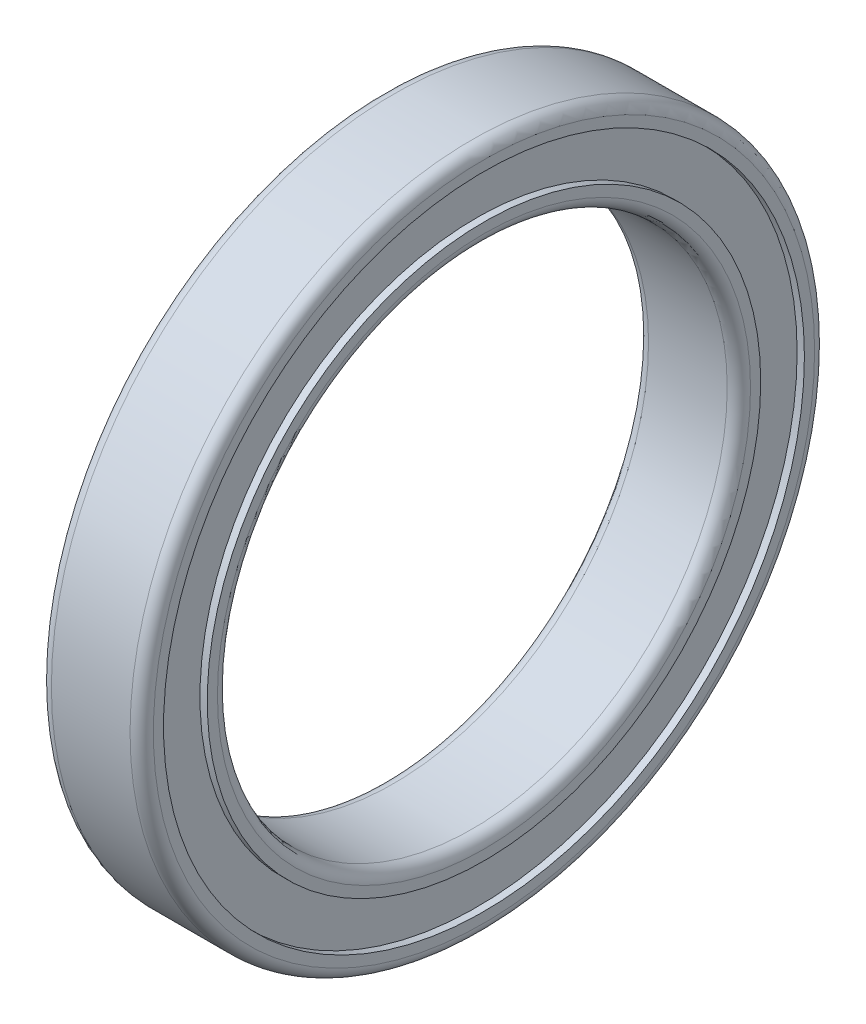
from build123d import *

# Parameters (mm, degrees)
FILLET_1_R = 0.8


with BuildPart() as part:
    # Sketch 1 → Revolve 1 (revolve)
    with BuildSketch(Plane.XY, mode=Mode.PRIVATE) as revolve_1_sk:
        Polygon((3.5, 17.5), (-3.5, 17.5), (-3.5, 19), (-3, 19), (-3, 22), (-3.5, 22), (-3.5, 23.5), (3.5, 23.5), (3.5, 22), (3, 22), (3, 19), (3.5, 19), align=None)
    revolve(revolve_1_sk.sketch.rotate(Axis((0, 0, 0), (-1, 0, 0)), 90), axis=Axis((0, 0, 0), (-1, 0, 0)))

    # Fillet 1
    fillet_1_edges = [part.edges().sort_by_distance(p)[0] for p in [
        (-3.5, 0, 23.5),
        (3.5, 0, 23.5),
        (3.5, 0, 17.5),
        (-3.5, 0, 17.5),
    ]]
    fillet(fillet_1_edges, radius=FILLET_1_R)


solid = part.part
